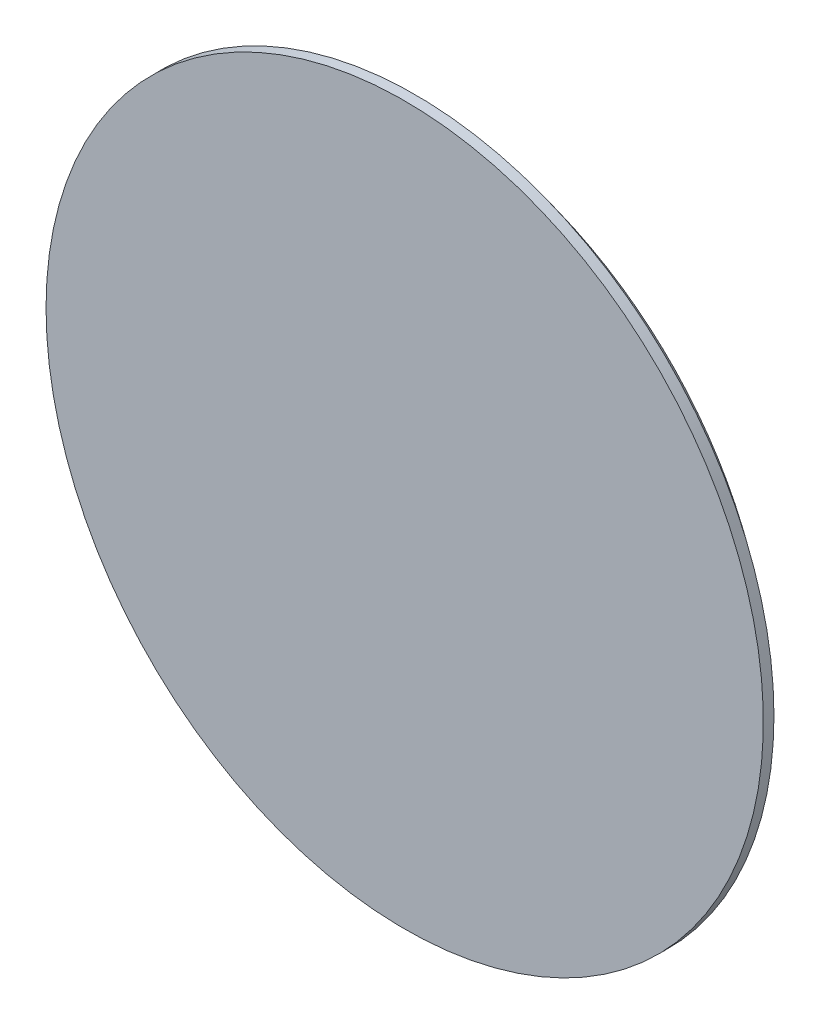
from build123d import *


with BuildPart() as part:
    # Sketch1 → Revolve1 (revolve)
    with BuildSketch(Plane(origin=(0, 0, 0), x_dir=(1, 0, 0), z_dir=(0, 1, 0))):
        with BuildLine():
            Line((203.2, 6), (203.2, 0))
            Line((203.2, 0), (0, 0))
            Line((0, 0), (0, 78))
            ThreePointArc((0, 78), (107.789424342, 59.467930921), (203.2, 6))
        make_face()
    revolve(axis=Axis((0, 0, -88.99), (0, 0, 1)))


solid = part.part
